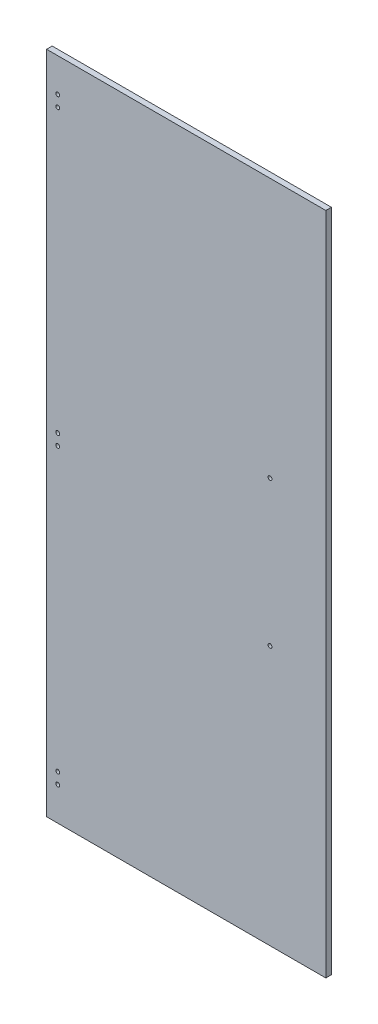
ISO-10303-21;
HEADER;
FILE_DESCRIPTION(('STEP AP214'),'2;1');
FILE_NAME('part.step','',(''),(''),'','','');
FILE_SCHEMA(('AUTOMOTIVE_DESIGN { 1 0 10303 214 1 1 1 1 }'));
ENDSEC;
DATA;
#1=APPLICATION_CONTEXT('core data for automotive mechanical design processes');
#2=APPLICATION_PROTOCOL_DEFINITION('international standard','automotive_design',2000,#1);
#3=PRODUCT_CONTEXT('',#1,'mechanical');
#4=PRODUCT('Part','Part','',(#3));
#5=PRODUCT_RELATED_PRODUCT_CATEGORY('part','',(#4));
#6=PRODUCT_DEFINITION_FORMATION('','',#4);
#7=PRODUCT_DEFINITION_CONTEXT('part definition',#1,'design');
#8=PRODUCT_DEFINITION('design','',#6,#7);
#9=PRODUCT_DEFINITION_SHAPE('','',#8);
#10=(LENGTH_UNIT() NAMED_UNIT(*) SI_UNIT(.MILLI.,.METRE.));
#11=(NAMED_UNIT(*) PLANE_ANGLE_UNIT() SI_UNIT($,.RADIAN.));
#12=(NAMED_UNIT(*) SI_UNIT($,.STERADIAN.) SOLID_ANGLE_UNIT());
#13=UNCERTAINTY_MEASURE_WITH_UNIT(LENGTH_MEASURE(1.E-05),#10,'distance_accuracy_value','');
#14=(GEOMETRIC_REPRESENTATION_CONTEXT(3) GLOBAL_UNCERTAINTY_ASSIGNED_CONTEXT((#13)) GLOBAL_UNIT_ASSIGNED_CONTEXT((#10,
#11,#12)) REPRESENTATION_CONTEXT('',''));
#15=CARTESIAN_POINT('',(0.,0.,0.));
#16=DIRECTION('',(0.,0.,1.));
#17=DIRECTION('',(1.,0.,0.));
#18=AXIS2_PLACEMENT_3D('',#15,#16,#17);
#19=CARTESIAN_POINT('',(125.,-297.5,5.));
#20=DIRECTION('',(-1.,0.,0.));
#21=DIRECTION('',(0.,0.,1.));
#22=AXIS2_PLACEMENT_3D('',#19,#20,#21);
#23=PLANE('',#22);
#24=DIRECTION('',(0.,1.,0.));
#25=VECTOR('',#24,1.);
#26=CARTESIAN_POINT('',(125.,-297.5,0.));
#27=LINE('',#26,#25);
#28=CARTESIAN_POINT('',(125.,-297.5,0.));
#29=VERTEX_POINT('',#28);
#30=CARTESIAN_POINT('',(125.,297.5,0.));
#31=VERTEX_POINT('',#30);
#32=EDGE_CURVE('E103',#29,#31,#27,.T.);
#33=ORIENTED_EDGE('',*,*,#32,.T.);
#34=DIRECTION('',(0.,0.,-1.));
#35=VECTOR('',#34,1.);
#36=CARTESIAN_POINT('',(125.,297.5,5.));
#37=LINE('',#36,#35);
#38=CARTESIAN_POINT('',(125.,297.5,5.));
#39=VERTEX_POINT('',#38);
#40=EDGE_CURVE('E11',#39,#31,#37,.T.);
#41=ORIENTED_EDGE('',*,*,#40,.F.);
#42=DIRECTION('',(0.,1.,0.));
#43=VECTOR('',#42,1.);
#44=CARTESIAN_POINT('',(125.,-297.5,5.));
#45=LINE('',#44,#43);
#46=CARTESIAN_POINT('',(125.,-297.5,5.));
#47=VERTEX_POINT('',#46);
#48=EDGE_CURVE('E90',#47,#39,#45,.T.);
#49=ORIENTED_EDGE('',*,*,#48,.F.);
#50=DIRECTION('',(0.,0.,-1.));
#51=VECTOR('',#50,1.);
#52=CARTESIAN_POINT('',(125.,-297.5,5.));
#53=LINE('',#52,#51);
#54=EDGE_CURVE('E99',#47,#29,#53,.T.);
#55=ORIENTED_EDGE('',*,*,#54,.T.);
#56=EDGE_LOOP('',(#33,#41,#49,#55));
#57=FACE_BOUND('',#56,.T.);
#58=ADVANCED_FACE('F37',(#57),#23,.F.);
#59=CARTESIAN_POINT('',(-125.,297.5,5.));
#60=DIRECTION('',(0.,-1.,0.));
#61=DIRECTION('',(0.,0.,-1.));
#62=AXIS2_PLACEMENT_3D('',#59,#60,#61);
#63=PLANE('',#62);
#64=DIRECTION('',(-1.,0.,0.));
#65=VECTOR('',#64,1.);
#66=CARTESIAN_POINT('',(-125.,297.5,0.));
#67=LINE('',#66,#65);
#68=CARTESIAN_POINT('',(-125.,297.5,0.));
#69=VERTEX_POINT('',#68);
#70=EDGE_CURVE('E94',#31,#69,#67,.T.);
#71=ORIENTED_EDGE('',*,*,#70,.T.);
#72=DIRECTION('',(0.,0.,-1.));
#73=VECTOR('',#72,1.);
#74=CARTESIAN_POINT('',(-125.,297.5,5.));
#75=LINE('',#74,#73);
#76=CARTESIAN_POINT('',(-125.,297.5,5.));
#77=VERTEX_POINT('',#76);
#78=EDGE_CURVE('E46',#77,#69,#75,.T.);
#79=ORIENTED_EDGE('',*,*,#78,.F.);
#80=DIRECTION('',(-1.,0.,0.));
#81=VECTOR('',#80,1.);
#82=CARTESIAN_POINT('',(-125.,297.5,5.));
#83=LINE('',#82,#81);
#84=EDGE_CURVE('E85',#39,#77,#83,.T.);
#85=ORIENTED_EDGE('',*,*,#84,.F.);
#86=ORIENTED_EDGE('',*,*,#40,.T.);
#87=EDGE_LOOP('',(#71,#79,#85,#86));
#88=FACE_BOUND('',#87,.T.);
#89=ADVANCED_FACE('F93',(#88),#63,.F.);
#90=CARTESIAN_POINT('',(-125.,-297.5,5.));
#91=DIRECTION('',(1.,0.,0.));
#92=DIRECTION('',(0.,0.,-1.));
#93=AXIS2_PLACEMENT_3D('',#90,#91,#92);
#94=PLANE('',#93);
#95=DIRECTION('',(0.,-1.,0.));
#96=VECTOR('',#95,1.);
#97=CARTESIAN_POINT('',(-125.,-297.5,0.));
#98=LINE('',#97,#96);
#99=CARTESIAN_POINT('',(-125.,-297.5,0.));
#100=VERTEX_POINT('',#99);
#101=EDGE_CURVE('E72',#69,#100,#98,.T.);
#102=ORIENTED_EDGE('',*,*,#101,.T.);
#103=DIRECTION('',(0.,0.,-1.));
#104=VECTOR('',#103,1.);
#105=CARTESIAN_POINT('',(-125.,-297.5,5.));
#106=LINE('',#105,#104);
#107=CARTESIAN_POINT('',(-125.,-297.5,5.));
#108=VERTEX_POINT('',#107);
#109=EDGE_CURVE('E95',#108,#100,#106,.T.);
#110=ORIENTED_EDGE('',*,*,#109,.F.);
#111=DIRECTION('',(0.,-1.,0.));
#112=VECTOR('',#111,1.);
#113=CARTESIAN_POINT('',(-125.,-297.5,5.));
#114=LINE('',#113,#112);
#115=EDGE_CURVE('E88',#77,#108,#114,.T.);
#116=ORIENTED_EDGE('',*,*,#115,.F.);
#117=ORIENTED_EDGE('',*,*,#78,.T.);
#118=EDGE_LOOP('',(#102,#110,#116,#117));
#119=FACE_BOUND('',#118,.T.);
#120=ADVANCED_FACE('F97',(#119),#94,.F.);
#121=CARTESIAN_POINT('',(-125.,-297.5,5.));
#122=DIRECTION('',(0.,1.,0.));
#123=DIRECTION('',(0.,0.,1.));
#124=AXIS2_PLACEMENT_3D('',#121,#122,#123);
#125=PLANE('',#124);
#126=DIRECTION('',(1.,0.,0.));
#127=VECTOR('',#126,1.);
#128=CARTESIAN_POINT('',(-125.,-297.5,0.));
#129=LINE('',#128,#127);
#130=EDGE_CURVE('E78',#100,#29,#129,.T.);
#131=ORIENTED_EDGE('',*,*,#130,.T.);
#132=ORIENTED_EDGE('',*,*,#54,.F.);
#133=DIRECTION('',(1.,0.,0.));
#134=VECTOR('',#133,1.);
#135=CARTESIAN_POINT('',(-125.,-297.5,5.));
#136=LINE('',#135,#134);
#137=EDGE_CURVE('E55',#108,#47,#136,.T.);
#138=ORIENTED_EDGE('',*,*,#137,.F.);
#139=ORIENTED_EDGE('',*,*,#109,.T.);
#140=EDGE_LOOP('',(#131,#132,#138,#139));
#141=FACE_BOUND('',#140,.T.);
#142=ADVANCED_FACE('F159',(#141),#125,.F.);
#143=CARTESIAN_POINT('',(0.,0.,5.));
#144=DIRECTION('',(0.,0.,-1.));
#145=DIRECTION('',(-1.,0.,0.));
#146=AXIS2_PLACEMENT_3D('',#143,#144,#145);
#147=PLANE('',#146);
#148=CARTESIAN_POINT('',(-115.,5.,5.));
#149=DIRECTION('',(0.,0.,1.));
#150=DIRECTION('',(-1.,0.,0.));
#151=AXIS2_PLACEMENT_3D('',#148,#149,#150);
#152=CIRCLE('',#151,1.75);
#153=CARTESIAN_POINT('',(-116.75,5.,5.));
#154=VERTEX_POINT('',#153);
#155=EDGE_CURVE('E314',#154,#154,#152,.T.);
#156=ORIENTED_EDGE('',*,*,#155,.F.);
#157=EDGE_LOOP('',(#156));
#158=FACE_BOUND('',#157,.T.);
#159=CARTESIAN_POINT('',(-115.,267.5,5.));
#160=DIRECTION('',(0.,0.,1.));
#161=DIRECTION('',(-1.,0.,0.));
#162=AXIS2_PLACEMENT_3D('',#159,#160,#161);
#163=CIRCLE('',#162,1.75);
#164=CARTESIAN_POINT('',(-116.75,267.5,5.));
#165=VERTEX_POINT('',#164);
#166=EDGE_CURVE('E312',#165,#165,#163,.T.);
#167=ORIENTED_EDGE('',*,*,#166,.F.);
#168=EDGE_LOOP('',(#167));
#169=FACE_BOUND('',#168,.T.);
#170=CARTESIAN_POINT('',(-115.,257.5,5.));
#171=DIRECTION('',(0.,0.,1.));
#172=DIRECTION('',(-1.,0.,0.));
#173=AXIS2_PLACEMENT_3D('',#170,#171,#172);
#174=CIRCLE('',#173,1.75);
#175=CARTESIAN_POINT('',(-116.75,257.5,5.));
#176=VERTEX_POINT('',#175);
#177=EDGE_CURVE('E315',#176,#176,#174,.T.);
#178=ORIENTED_EDGE('',*,*,#177,.F.);
#179=EDGE_LOOP('',(#178));
#180=FACE_BOUND('',#179,.T.);
#181=CARTESIAN_POINT('',(75.,-65.,5.));
#182=DIRECTION('',(0.,0.,1.));
#183=DIRECTION('',(1.,0.,0.));
#184=AXIS2_PLACEMENT_3D('',#181,#182,#183);
#185=CIRCLE('',#184,1.75);
#186=CARTESIAN_POINT('',(76.75,-65.,5.));
#187=VERTEX_POINT('',#186);
#188=EDGE_CURVE('E324',#187,#187,#185,.T.);
#189=ORIENTED_EDGE('',*,*,#188,.F.);
#190=EDGE_LOOP('',(#189));
#191=FACE_BOUND('',#190,.T.);
#192=CARTESIAN_POINT('',(-115.,-267.5,5.));
#193=DIRECTION('',(0.,0.,1.));
#194=DIRECTION('',(1.,0.,0.));
#195=AXIS2_PLACEMENT_3D('',#192,#193,#194);
#196=CIRCLE('',#195,1.75);
#197=CARTESIAN_POINT('',(-113.25,-267.5,5.));
#198=VERTEX_POINT('',#197);
#199=EDGE_CURVE('E328',#198,#198,#196,.T.);
#200=ORIENTED_EDGE('',*,*,#199,.F.);
#201=EDGE_LOOP('',(#200));
#202=FACE_BOUND('',#201,.T.);
#203=CARTESIAN_POINT('',(-115.,-257.5,5.));
#204=DIRECTION('',(0.,0.,1.));
#205=DIRECTION('',(1.,0.,0.));
#206=AXIS2_PLACEMENT_3D('',#203,#204,#205);
#207=CIRCLE('',#206,1.75);
#208=CARTESIAN_POINT('',(-113.25,-257.5,5.));
#209=VERTEX_POINT('',#208);
#210=EDGE_CURVE('E333',#209,#209,#207,.T.);
#211=ORIENTED_EDGE('',*,*,#210,.F.);
#212=EDGE_LOOP('',(#211));
#213=FACE_BOUND('',#212,.T.);
#214=CARTESIAN_POINT('',(-115.,-5.,5.));
#215=DIRECTION('',(0.,0.,1.));
#216=DIRECTION('',(-1.,0.,0.));
#217=AXIS2_PLACEMENT_3D('',#214,#215,#216);
#218=CIRCLE('',#217,1.75);
#219=CARTESIAN_POINT('',(-116.75,-5.,5.));
#220=VERTEX_POINT('',#219);
#221=EDGE_CURVE('E318',#220,#220,#218,.T.);
#222=ORIENTED_EDGE('',*,*,#221,.F.);
#223=EDGE_LOOP('',(#222));
#224=FACE_BOUND('',#223,.T.);
#225=CARTESIAN_POINT('',(75.,65.,5.));
#226=DIRECTION('',(0.,0.,1.));
#227=DIRECTION('',(1.,0.,0.));
#228=AXIS2_PLACEMENT_3D('',#225,#226,#227);
#229=CIRCLE('',#228,1.75);
#230=CARTESIAN_POINT('',(76.75,65.,5.));
#231=VERTEX_POINT('',#230);
#232=EDGE_CURVE('E115',#231,#231,#229,.T.);
#233=ORIENTED_EDGE('',*,*,#232,.F.);
#234=EDGE_LOOP('',(#233));
#235=FACE_BOUND('',#234,.T.);
#236=ORIENTED_EDGE('',*,*,#48,.T.);
#237=ORIENTED_EDGE('',*,*,#84,.T.);
#238=ORIENTED_EDGE('',*,*,#115,.T.);
#239=ORIENTED_EDGE('',*,*,#137,.T.);
#240=EDGE_LOOP('',(#236,#237,#238,#239));
#241=FACE_BOUND('',#240,.T.);
#242=ADVANCED_FACE('F86',(#158,#169,#180,#191,#202,#213,#224,#235,#241),#147,.F.);
#243=CARTESIAN_POINT('',(0.,0.,0.));
#244=DIRECTION('',(0.,0.,-1.));
#245=DIRECTION('',(-1.,0.,0.));
#246=AXIS2_PLACEMENT_3D('',#243,#244,#245);
#247=PLANE('',#246);
#248=CARTESIAN_POINT('',(-115.,5.,0.));
#249=DIRECTION('',(0.,0.,-1.));
#250=DIRECTION('',(-1.,0.,0.));
#251=AXIS2_PLACEMENT_3D('',#248,#249,#250);
#252=CIRCLE('',#251,1.75);
#253=CARTESIAN_POINT('',(-116.75,5.,0.));
#254=VERTEX_POINT('',#253);
#255=EDGE_CURVE('E40',#254,#254,#252,.T.);
#256=ORIENTED_EDGE('',*,*,#255,.F.);
#257=EDGE_LOOP('',(#256));
#258=FACE_BOUND('',#257,.T.);
#259=CARTESIAN_POINT('',(-115.,267.5,0.));
#260=DIRECTION('',(0.,0.,-1.));
#261=DIRECTION('',(-1.,0.,0.));
#262=AXIS2_PLACEMENT_3D('',#259,#260,#261);
#263=CIRCLE('',#262,1.75);
#264=CARTESIAN_POINT('',(-116.75,267.5,0.));
#265=VERTEX_POINT('',#264);
#266=EDGE_CURVE('E129',#265,#265,#263,.T.);
#267=ORIENTED_EDGE('',*,*,#266,.F.);
#268=EDGE_LOOP('',(#267));
#269=FACE_BOUND('',#268,.T.);
#270=CARTESIAN_POINT('',(-115.,257.5,0.));
#271=DIRECTION('',(0.,0.,-1.));
#272=DIRECTION('',(-1.,0.,0.));
#273=AXIS2_PLACEMENT_3D('',#270,#271,#272);
#274=CIRCLE('',#273,1.75);
#275=CARTESIAN_POINT('',(-116.75,257.5,0.));
#276=VERTEX_POINT('',#275);
#277=EDGE_CURVE('E127',#276,#276,#274,.T.);
#278=ORIENTED_EDGE('',*,*,#277,.F.);
#279=EDGE_LOOP('',(#278));
#280=FACE_BOUND('',#279,.T.);
#281=CARTESIAN_POINT('',(75.,-65.,0.));
#282=DIRECTION('',(0.,0.,-1.));
#283=DIRECTION('',(-1.,0.,0.));
#284=AXIS2_PLACEMENT_3D('',#281,#282,#283);
#285=CIRCLE('',#284,1.75);
#286=CARTESIAN_POINT('',(73.25,-65.,0.));
#287=VERTEX_POINT('',#286);
#288=EDGE_CURVE('E124',#287,#287,#285,.T.);
#289=ORIENTED_EDGE('',*,*,#288,.F.);
#290=EDGE_LOOP('',(#289));
#291=FACE_BOUND('',#290,.T.);
#292=CARTESIAN_POINT('',(-115.,-267.5,0.));
#293=DIRECTION('',(0.,0.,-1.));
#294=DIRECTION('',(-1.,0.,0.));
#295=AXIS2_PLACEMENT_3D('',#292,#293,#294);
#296=CIRCLE('',#295,1.75);
#297=CARTESIAN_POINT('',(-116.75,-267.5,0.));
#298=VERTEX_POINT('',#297);
#299=EDGE_CURVE('E121',#298,#298,#296,.T.);
#300=ORIENTED_EDGE('',*,*,#299,.F.);
#301=EDGE_LOOP('',(#300));
#302=FACE_BOUND('',#301,.T.);
#303=CARTESIAN_POINT('',(-115.,-257.5,0.));
#304=DIRECTION('',(0.,0.,-1.));
#305=DIRECTION('',(-1.,0.,0.));
#306=AXIS2_PLACEMENT_3D('',#303,#304,#305);
#307=CIRCLE('',#306,1.75);
#308=CARTESIAN_POINT('',(-116.75,-257.5,0.));
#309=VERTEX_POINT('',#308);
#310=EDGE_CURVE('E118',#309,#309,#307,.T.);
#311=ORIENTED_EDGE('',*,*,#310,.F.);
#312=EDGE_LOOP('',(#311));
#313=FACE_BOUND('',#312,.T.);
#314=CARTESIAN_POINT('',(-115.,-5.,0.));
#315=DIRECTION('',(0.,0.,-1.));
#316=DIRECTION('',(-1.,0.,0.));
#317=AXIS2_PLACEMENT_3D('',#314,#315,#316);
#318=CIRCLE('',#317,1.75);
#319=CARTESIAN_POINT('',(-116.75,-5.,0.));
#320=VERTEX_POINT('',#319);
#321=EDGE_CURVE('E114',#320,#320,#318,.T.);
#322=ORIENTED_EDGE('',*,*,#321,.F.);
#323=EDGE_LOOP('',(#322));
#324=FACE_BOUND('',#323,.T.);
#325=CARTESIAN_POINT('',(75.,65.,0.));
#326=DIRECTION('',(0.,0.,-1.));
#327=DIRECTION('',(-1.,0.,0.));
#328=AXIS2_PLACEMENT_3D('',#325,#326,#327);
#329=CIRCLE('',#328,1.75);
#330=CARTESIAN_POINT('',(73.25,65.,0.));
#331=VERTEX_POINT('',#330);
#332=EDGE_CURVE('E111',#331,#331,#329,.T.);
#333=ORIENTED_EDGE('',*,*,#332,.F.);
#334=EDGE_LOOP('',(#333));
#335=FACE_BOUND('',#334,.T.);
#336=ORIENTED_EDGE('',*,*,#32,.F.);
#337=ORIENTED_EDGE('',*,*,#130,.F.);
#338=ORIENTED_EDGE('',*,*,#101,.F.);
#339=ORIENTED_EDGE('',*,*,#70,.F.);
#340=EDGE_LOOP('',(#336,#337,#338,#339));
#341=FACE_BOUND('',#340,.T.);
#342=ADVANCED_FACE('F139',(#258,#269,#280,#291,#302,#313,#324,#335,#341),#247,.T.);
#343=CARTESIAN_POINT('',(75.,65.,-25.));
#344=DIRECTION('',(0.,0.,1.));
#345=DIRECTION('',(1.,0.,0.));
#346=AXIS2_PLACEMENT_3D('',#343,#344,#345);
#347=CYLINDRICAL_SURFACE('',#346,1.75);
#348=ORIENTED_EDGE('',*,*,#332,.T.);
#349=EDGE_LOOP('',(#348));
#350=FACE_BOUND('',#349,.T.);
#351=ORIENTED_EDGE('',*,*,#232,.T.);
#352=EDGE_LOOP('',(#351));
#353=FACE_BOUND('',#352,.T.);
#354=ADVANCED_FACE('F142',(#350,#353),#347,.F.);
#355=CARTESIAN_POINT('',(-115.,-5.,-25.));
#356=DIRECTION('',(0.,0.,1.));
#357=DIRECTION('',(1.,0.,0.));
#358=AXIS2_PLACEMENT_3D('',#355,#356,#357);
#359=CYLINDRICAL_SURFACE('',#358,1.75);
#360=ORIENTED_EDGE('',*,*,#321,.T.);
#361=EDGE_LOOP('',(#360));
#362=FACE_BOUND('',#361,.T.);
#363=ORIENTED_EDGE('',*,*,#221,.T.);
#364=EDGE_LOOP('',(#363));
#365=FACE_BOUND('',#364,.T.);
#366=ADVANCED_FACE('F208',(#362,#365),#359,.F.);
#367=CARTESIAN_POINT('',(-115.,-257.5,-25.));
#368=DIRECTION('',(0.,0.,1.));
#369=DIRECTION('',(1.,0.,0.));
#370=AXIS2_PLACEMENT_3D('',#367,#368,#369);
#371=CYLINDRICAL_SURFACE('',#370,1.75);
#372=ORIENTED_EDGE('',*,*,#310,.T.);
#373=EDGE_LOOP('',(#372));
#374=FACE_BOUND('',#373,.T.);
#375=ORIENTED_EDGE('',*,*,#210,.T.);
#376=EDGE_LOOP('',(#375));
#377=FACE_BOUND('',#376,.T.);
#378=ADVANCED_FACE('F219',(#374,#377),#371,.F.);
#379=CARTESIAN_POINT('',(-115.,-267.5,-25.));
#380=DIRECTION('',(0.,0.,1.));
#381=DIRECTION('',(1.,0.,0.));
#382=AXIS2_PLACEMENT_3D('',#379,#380,#381);
#383=CYLINDRICAL_SURFACE('',#382,1.75);
#384=ORIENTED_EDGE('',*,*,#299,.T.);
#385=EDGE_LOOP('',(#384));
#386=FACE_BOUND('',#385,.T.);
#387=ORIENTED_EDGE('',*,*,#199,.T.);
#388=EDGE_LOOP('',(#387));
#389=FACE_BOUND('',#388,.T.);
#390=ADVANCED_FACE('F230',(#386,#389),#383,.F.);
#391=CARTESIAN_POINT('',(75.,-65.,-25.));
#392=DIRECTION('',(0.,0.,1.));
#393=DIRECTION('',(1.,0.,0.));
#394=AXIS2_PLACEMENT_3D('',#391,#392,#393);
#395=CYLINDRICAL_SURFACE('',#394,1.75);
#396=ORIENTED_EDGE('',*,*,#288,.T.);
#397=EDGE_LOOP('',(#396));
#398=FACE_BOUND('',#397,.T.);
#399=ORIENTED_EDGE('',*,*,#188,.T.);
#400=EDGE_LOOP('',(#399));
#401=FACE_BOUND('',#400,.T.);
#402=ADVANCED_FACE('F241',(#398,#401),#395,.F.);
#403=CARTESIAN_POINT('',(-115.,257.5,-25.));
#404=DIRECTION('',(0.,0.,1.));
#405=DIRECTION('',(1.,0.,0.));
#406=AXIS2_PLACEMENT_3D('',#403,#404,#405);
#407=CYLINDRICAL_SURFACE('',#406,1.75);
#408=ORIENTED_EDGE('',*,*,#277,.T.);
#409=EDGE_LOOP('',(#408));
#410=FACE_BOUND('',#409,.T.);
#411=ORIENTED_EDGE('',*,*,#177,.T.);
#412=EDGE_LOOP('',(#411));
#413=FACE_BOUND('',#412,.T.);
#414=ADVANCED_FACE('F252',(#410,#413),#407,.F.);
#415=CARTESIAN_POINT('',(-115.,267.5,-25.));
#416=DIRECTION('',(0.,0.,1.));
#417=DIRECTION('',(1.,0.,0.));
#418=AXIS2_PLACEMENT_3D('',#415,#416,#417);
#419=CYLINDRICAL_SURFACE('',#418,1.75);
#420=ORIENTED_EDGE('',*,*,#266,.T.);
#421=EDGE_LOOP('',(#420));
#422=FACE_BOUND('',#421,.T.);
#423=ORIENTED_EDGE('',*,*,#166,.T.);
#424=EDGE_LOOP('',(#423));
#425=FACE_BOUND('',#424,.T.);
#426=ADVANCED_FACE('F263',(#422,#425),#419,.F.);
#427=CARTESIAN_POINT('',(-115.,5.,-25.));
#428=DIRECTION('',(0.,0.,1.));
#429=DIRECTION('',(1.,0.,0.));
#430=AXIS2_PLACEMENT_3D('',#427,#428,#429);
#431=CYLINDRICAL_SURFACE('',#430,1.75);
#432=ORIENTED_EDGE('',*,*,#255,.T.);
#433=EDGE_LOOP('',(#432));
#434=FACE_BOUND('',#433,.T.);
#435=ORIENTED_EDGE('',*,*,#155,.T.);
#436=EDGE_LOOP('',(#435));
#437=FACE_BOUND('',#436,.T.);
#438=ADVANCED_FACE('F136',(#434,#437),#431,.F.);
#439=CLOSED_SHELL('',(#58,#89,#120,#142,#242,#342,#354,#366,#378,#390,#402,#414,#426,#438));
#440=MANIFOLD_SOLID_BREP('B2',#439);
#441=ADVANCED_BREP_SHAPE_REPRESENTATION('',(#18,#440),#14);
#442=SHAPE_DEFINITION_REPRESENTATION(#9,#441);
ENDSEC;
END-ISO-10303-21;
